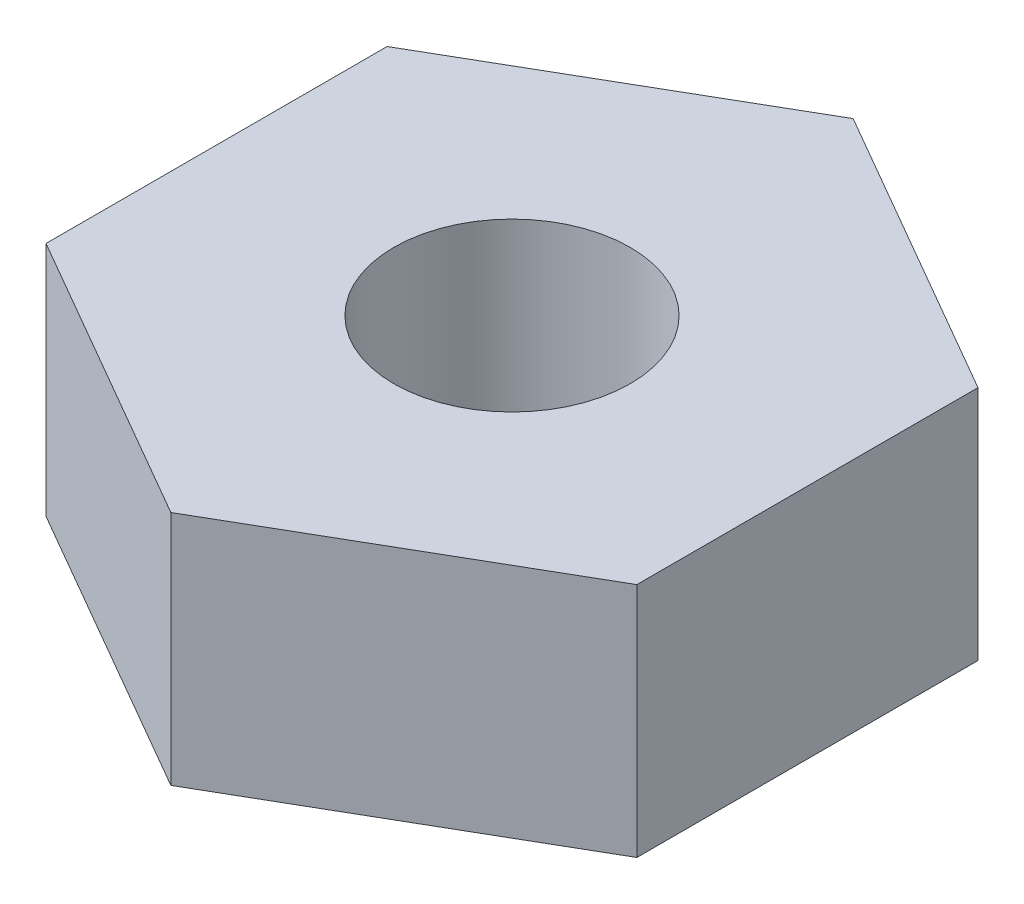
ISO-10303-21;
HEADER;
FILE_DESCRIPTION(('STEP AP214'),'2;1');
FILE_NAME('part.step','',(''),(''),'','','');
FILE_SCHEMA(('AUTOMOTIVE_DESIGN { 1 0 10303 214 1 1 1 1 }'));
ENDSEC;
DATA;
#1=APPLICATION_CONTEXT('core data for automotive mechanical design processes');
#2=APPLICATION_PROTOCOL_DEFINITION('international standard','automotive_design',2000,#1);
#3=PRODUCT_CONTEXT('',#1,'mechanical');
#4=PRODUCT('Part','Part','',(#3));
#5=PRODUCT_RELATED_PRODUCT_CATEGORY('part','',(#4));
#6=PRODUCT_DEFINITION_FORMATION('','',#4);
#7=PRODUCT_DEFINITION_CONTEXT('part definition',#1,'design');
#8=PRODUCT_DEFINITION('design','',#6,#7);
#9=PRODUCT_DEFINITION_SHAPE('','',#8);
#10=(LENGTH_UNIT() NAMED_UNIT(*) SI_UNIT(.MILLI.,.METRE.));
#11=(NAMED_UNIT(*) PLANE_ANGLE_UNIT() SI_UNIT($,.RADIAN.));
#12=(NAMED_UNIT(*) SI_UNIT($,.STERADIAN.) SOLID_ANGLE_UNIT());
#13=UNCERTAINTY_MEASURE_WITH_UNIT(LENGTH_MEASURE(1.E-05),#10,'distance_accuracy_value','');
#14=(GEOMETRIC_REPRESENTATION_CONTEXT(3) GLOBAL_UNCERTAINTY_ASSIGNED_CONTEXT((#13)) GLOBAL_UNIT_ASSIGNED_CONTEXT((#10,
#11,#12)) REPRESENTATION_CONTEXT('',''));
#15=CARTESIAN_POINT('',(0.,0.,0.));
#16=DIRECTION('',(0.,0.,1.));
#17=DIRECTION('',(1.,0.,0.));
#18=AXIS2_PLACEMENT_3D('',#15,#16,#17);
#19=CARTESIAN_POINT('',(0.,0.,0.));
#20=DIRECTION('',(0.,-1.,0.));
#21=DIRECTION('',(0.,0.,-1.));
#22=AXIS2_PLACEMENT_3D('',#19,#20,#21);
#23=PLANE('',#22);
#24=CARTESIAN_POINT('',(0.,0.,0.));
#25=DIRECTION('',(0.,1.,0.));
#26=DIRECTION('',(0.,0.,1.));
#27=AXIS2_PLACEMENT_3D('',#24,#25,#26);
#28=CIRCLE('',#27,0.8);
#29=CARTESIAN_POINT('',(0.,0.,0.8));
#30=VERTEX_POINT('',#29);
#31=EDGE_CURVE('E19',#30,#30,#28,.F.);
#32=ORIENTED_EDGE('',*,*,#31,.T.);
#33=EDGE_LOOP('',(#32));
#34=FACE_BOUND('',#33,.T.);
#35=DIRECTION('',(-0.866025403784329,0.,-0.50000000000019));
#36=VECTOR('',#35,1.);
#37=CARTESIAN_POINT('',(0.,0.,-2.309401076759));
#38=LINE('',#37,#36);
#39=CARTESIAN_POINT('',(0.,0.,-2.30940107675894));
#40=VERTEX_POINT('',#39);
#41=CARTESIAN_POINT('',(2.00000000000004,0.,-1.15470053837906));
#42=VERTEX_POINT('',#41);
#43=EDGE_CURVE('E102',#40,#42,#38,.F.);
#44=ORIENTED_EDGE('',*,*,#43,.F.);
#45=DIRECTION('',(-0.866025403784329,0.,0.50000000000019));
#46=VECTOR('',#45,1.);
#47=CARTESIAN_POINT('',(-2.,0.,-1.154700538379));
#48=LINE('',#47,#46);
#49=CARTESIAN_POINT('',(-2.,0.,-1.154700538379));
#50=VERTEX_POINT('',#49);
#51=EDGE_CURVE('E97',#50,#40,#48,.F.);
#52=ORIENTED_EDGE('',*,*,#51,.F.);
#53=DIRECTION('',(0.,0.,1.));
#54=VECTOR('',#53,1.);
#55=CARTESIAN_POINT('',(-2.,0.,1.154700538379));
#56=LINE('',#55,#54);
#57=CARTESIAN_POINT('',(-2.00000000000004,0.,1.15470053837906));
#58=VERTEX_POINT('',#57);
#59=EDGE_CURVE('E82',#58,#50,#56,.F.);
#60=ORIENTED_EDGE('',*,*,#59,.F.);
#61=DIRECTION('',(0.866025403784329,0.,0.50000000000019));
#62=VECTOR('',#61,1.);
#63=CARTESIAN_POINT('',(0.,0.,2.309401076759));
#64=LINE('',#63,#62);
#65=CARTESIAN_POINT('',(0.,0.,2.30940107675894));
#66=VERTEX_POINT('',#65);
#67=EDGE_CURVE('E65',#66,#58,#64,.F.);
#68=ORIENTED_EDGE('',*,*,#67,.F.);
#69=DIRECTION('',(0.866025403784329,0.,-0.50000000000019));
#70=VECTOR('',#69,1.);
#71=CARTESIAN_POINT('',(2.,0.,1.154700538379));
#72=LINE('',#71,#70);
#73=CARTESIAN_POINT('',(2.,0.,1.154700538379));
#74=VERTEX_POINT('',#73);
#75=EDGE_CURVE('E70',#74,#66,#72,.F.);
#76=ORIENTED_EDGE('',*,*,#75,.F.);
#77=DIRECTION('',(0.,0.,-1.));
#78=VECTOR('',#77,1.);
#79=CARTESIAN_POINT('',(2.,0.,-1.154700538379));
#80=LINE('',#79,#78);
#81=EDGE_CURVE('E105',#42,#74,#80,.F.);
#82=ORIENTED_EDGE('',*,*,#81,.F.);
#83=EDGE_LOOP('',(#44,#52,#60,#68,#76,#82));
#84=FACE_BOUND('',#83,.T.);
#85=ADVANCED_FACE('F16',(#34,#84),#23,.F.);
#86=CARTESIAN_POINT('',(2.,-1.6,1.154700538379));
#87=DIRECTION('',(0.50000000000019,0.,0.866025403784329));
#88=DIRECTION('',(0.866025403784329,0.,-0.50000000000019));
#89=AXIS2_PLACEMENT_3D('',#86,#87,#88);
#90=PLANE('',#89);
#91=DIRECTION('',(0.,1.,0.));
#92=VECTOR('',#91,1.);
#93=CARTESIAN_POINT('',(0.,-1.6,2.309401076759));
#94=LINE('',#93,#92);
#95=CARTESIAN_POINT('',(0.,-1.6,2.30940107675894));
#96=VERTEX_POINT('',#95);
#97=EDGE_CURVE('E72',#96,#66,#94,.T.);
#98=ORIENTED_EDGE('',*,*,#97,.F.);
#99=DIRECTION('',(-0.866025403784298,0.,0.500000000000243));
#100=VECTOR('',#99,1.);
#101=CARTESIAN_POINT('',(2.,-1.6,1.154700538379));
#102=LINE('',#101,#100);
#103=CARTESIAN_POINT('',(2.,-1.6,1.154700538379));
#104=VERTEX_POINT('',#103);
#105=EDGE_CURVE('E108',#104,#96,#102,.T.);
#106=ORIENTED_EDGE('',*,*,#105,.F.);
#107=DIRECTION('',(0.,1.,0.));
#108=VECTOR('',#107,1.);
#109=CARTESIAN_POINT('',(2.,-1.6,1.154700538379));
#110=LINE('',#109,#108);
#111=EDGE_CURVE('E75',#74,#104,#110,.F.);
#112=ORIENTED_EDGE('',*,*,#111,.F.);
#113=ORIENTED_EDGE('',*,*,#75,.T.);
#114=EDGE_LOOP('',(#98,#106,#112,#113));
#115=FACE_BOUND('',#114,.T.);
#116=ADVANCED_FACE('F71',(#115),#90,.T.);
#117=CARTESIAN_POINT('',(0.,-1.6,2.309401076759));
#118=DIRECTION('',(-0.50000000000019,0.,0.866025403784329));
#119=DIRECTION('',(0.866025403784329,0.,0.50000000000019));
#120=AXIS2_PLACEMENT_3D('',#117,#118,#119);
#121=PLANE('',#120);
#122=DIRECTION('',(0.,1.,0.));
#123=VECTOR('',#122,1.);
#124=CARTESIAN_POINT('',(-2.,-1.6,1.154700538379));
#125=LINE('',#124,#123);
#126=CARTESIAN_POINT('',(-2.00000000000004,-1.6,1.15470053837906));
#127=VERTEX_POINT('',#126);
#128=EDGE_CURVE('E84',#127,#58,#125,.T.);
#129=ORIENTED_EDGE('',*,*,#128,.F.);
#130=DIRECTION('',(-0.866025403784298,0.,-0.500000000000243));
#131=VECTOR('',#130,1.);
#132=CARTESIAN_POINT('',(0.,-1.6,2.309401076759));
#133=LINE('',#132,#131);
#134=EDGE_CURVE('E88',#96,#127,#133,.T.);
#135=ORIENTED_EDGE('',*,*,#134,.F.);
#136=ORIENTED_EDGE('',*,*,#97,.T.);
#137=ORIENTED_EDGE('',*,*,#67,.T.);
#138=EDGE_LOOP('',(#129,#135,#136,#137));
#139=FACE_BOUND('',#138,.T.);
#140=ADVANCED_FACE('F86',(#139),#121,.T.);
#141=CARTESIAN_POINT('',(-2.,-1.6,1.154700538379));
#142=DIRECTION('',(-1.,0.,0.));
#143=DIRECTION('',(0.,0.,1.));
#144=AXIS2_PLACEMENT_3D('',#141,#142,#143);
#145=PLANE('',#144);
#146=DIRECTION('',(0.,1.,0.));
#147=VECTOR('',#146,1.);
#148=CARTESIAN_POINT('',(-2.,-1.6,-1.154700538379));
#149=LINE('',#148,#147);
#150=CARTESIAN_POINT('',(-2.,-1.6,-1.154700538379));
#151=VERTEX_POINT('',#150);
#152=EDGE_CURVE('E94',#151,#50,#149,.T.);
#153=ORIENTED_EDGE('',*,*,#152,.F.);
#154=DIRECTION('',(0.,0.,-1.));
#155=VECTOR('',#154,1.);
#156=CARTESIAN_POINT('',(-2.,-1.6,0.));
#157=LINE('',#156,#155);
#158=EDGE_CURVE('E111',#127,#151,#157,.T.);
#159=ORIENTED_EDGE('',*,*,#158,.F.);
#160=ORIENTED_EDGE('',*,*,#128,.T.);
#161=ORIENTED_EDGE('',*,*,#59,.T.);
#162=EDGE_LOOP('',(#153,#159,#160,#161));
#163=FACE_BOUND('',#162,.T.);
#164=ADVANCED_FACE('F131',(#163),#145,.T.);
#165=CARTESIAN_POINT('',(-2.,-1.6,-1.154700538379));
#166=DIRECTION('',(-0.50000000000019,0.,-0.866025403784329));
#167=DIRECTION('',(-0.866025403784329,0.,0.50000000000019));
#168=AXIS2_PLACEMENT_3D('',#165,#166,#167);
#169=PLANE('',#168);
#170=DIRECTION('',(0.,1.,0.));
#171=VECTOR('',#170,1.);
#172=CARTESIAN_POINT('',(0.,-1.6,-2.309401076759));
#173=LINE('',#172,#171);
#174=CARTESIAN_POINT('',(0.,-1.6,-2.30940107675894));
#175=VERTEX_POINT('',#174);
#176=EDGE_CURVE('E99',#175,#40,#173,.T.);
#177=ORIENTED_EDGE('',*,*,#176,.F.);
#178=DIRECTION('',(0.866025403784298,0.,-0.500000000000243));
#179=VECTOR('',#178,1.);
#180=CARTESIAN_POINT('',(-2.,-1.6,-1.154700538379));
#181=LINE('',#180,#179);
#182=EDGE_CURVE('E114',#151,#175,#181,.T.);
#183=ORIENTED_EDGE('',*,*,#182,.F.);
#184=ORIENTED_EDGE('',*,*,#152,.T.);
#185=ORIENTED_EDGE('',*,*,#51,.T.);
#186=EDGE_LOOP('',(#177,#183,#184,#185));
#187=FACE_BOUND('',#186,.T.);
#188=ADVANCED_FACE('F128',(#187),#169,.T.);
#189=CARTESIAN_POINT('',(0.,-1.6,-2.309401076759));
#190=DIRECTION('',(0.50000000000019,0.,-0.866025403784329));
#191=DIRECTION('',(-0.866025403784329,0.,-0.50000000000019));
#192=AXIS2_PLACEMENT_3D('',#189,#190,#191);
#193=PLANE('',#192);
#194=DIRECTION('',(0.,1.,0.));
#195=VECTOR('',#194,1.);
#196=CARTESIAN_POINT('',(2.,-1.6,-1.154700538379));
#197=LINE('',#196,#195);
#198=CARTESIAN_POINT('',(2.00000000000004,-1.6,-1.15470053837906));
#199=VERTEX_POINT('',#198);
#200=EDGE_CURVE('E33',#199,#42,#197,.T.);
#201=ORIENTED_EDGE('',*,*,#200,.F.);
#202=DIRECTION('',(0.866025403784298,0.,0.500000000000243));
#203=VECTOR('',#202,1.);
#204=CARTESIAN_POINT('',(0.,-1.6,-2.309401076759));
#205=LINE('',#204,#203);
#206=EDGE_CURVE('E117',#175,#199,#205,.T.);
#207=ORIENTED_EDGE('',*,*,#206,.F.);
#208=ORIENTED_EDGE('',*,*,#176,.T.);
#209=ORIENTED_EDGE('',*,*,#43,.T.);
#210=EDGE_LOOP('',(#201,#207,#208,#209));
#211=FACE_BOUND('',#210,.T.);
#212=ADVANCED_FACE('F125',(#211),#193,.T.);
#213=CARTESIAN_POINT('',(2.,-1.6,-1.154700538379));
#214=DIRECTION('',(1.,0.,0.));
#215=DIRECTION('',(0.,0.,-1.));
#216=AXIS2_PLACEMENT_3D('',#213,#214,#215);
#217=PLANE('',#216);
#218=ORIENTED_EDGE('',*,*,#111,.T.);
#219=DIRECTION('',(0.,0.,-1.));
#220=VECTOR('',#219,1.);
#221=CARTESIAN_POINT('',(2.,-1.6,0.));
#222=LINE('',#221,#220);
#223=EDGE_CURVE('E25',#199,#104,#222,.F.);
#224=ORIENTED_EDGE('',*,*,#223,.F.);
#225=ORIENTED_EDGE('',*,*,#200,.T.);
#226=ORIENTED_EDGE('',*,*,#81,.T.);
#227=EDGE_LOOP('',(#218,#224,#225,#226));
#228=FACE_BOUND('',#227,.T.);
#229=ADVANCED_FACE('F124',(#228),#217,.T.);
#230=CARTESIAN_POINT('',(0.,-1.7,0.));
#231=DIRECTION('',(0.,1.,0.));
#232=DIRECTION('',(0.,0.,1.));
#233=AXIS2_PLACEMENT_3D('',#230,#231,#232);
#234=CYLINDRICAL_SURFACE('',#233,0.8);
#235=CARTESIAN_POINT('',(0.,-1.6,0.));
#236=DIRECTION('',(0.,1.,0.));
#237=DIRECTION('',(0.,0.,1.));
#238=AXIS2_PLACEMENT_3D('',#235,#236,#237);
#239=CIRCLE('',#238,0.8);
#240=CARTESIAN_POINT('',(0.,-1.6,0.8));
#241=VERTEX_POINT('',#240);
#242=EDGE_CURVE('E10',#241,#241,#239,.T.);
#243=ORIENTED_EDGE('',*,*,#242,.F.);
#244=EDGE_LOOP('',(#243));
#245=FACE_BOUND('',#244,.T.);
#246=ORIENTED_EDGE('',*,*,#31,.F.);
#247=EDGE_LOOP('',(#246));
#248=FACE_BOUND('',#247,.T.);
#249=ADVANCED_FACE('F142',(#245,#248),#234,.F.);
#250=CARTESIAN_POINT('',(0.,-1.6,0.));
#251=DIRECTION('',(0.,-1.,0.));
#252=DIRECTION('',(0.,0.,-1.));
#253=AXIS2_PLACEMENT_3D('',#250,#251,#252);
#254=PLANE('',#253);
#255=ORIENTED_EDGE('',*,*,#242,.T.);
#256=EDGE_LOOP('',(#255));
#257=FACE_BOUND('',#256,.T.);
#258=ORIENTED_EDGE('',*,*,#206,.T.);
#259=ORIENTED_EDGE('',*,*,#223,.T.);
#260=ORIENTED_EDGE('',*,*,#105,.T.);
#261=ORIENTED_EDGE('',*,*,#134,.T.);
#262=ORIENTED_EDGE('',*,*,#158,.T.);
#263=ORIENTED_EDGE('',*,*,#182,.T.);
#264=EDGE_LOOP('',(#258,#259,#260,#261,#262,#263));
#265=FACE_BOUND('',#264,.T.);
#266=ADVANCED_FACE('F122',(#257,#265),#254,.T.);
#267=CLOSED_SHELL('',(#85,#116,#140,#164,#188,#212,#229,#249,#266));
#268=MANIFOLD_SOLID_BREP('B1',#267);
#269=ADVANCED_BREP_SHAPE_REPRESENTATION('',(#18,#268),#14);
#270=SHAPE_DEFINITION_REPRESENTATION(#9,#269);
ENDSEC;
END-ISO-10303-21;
